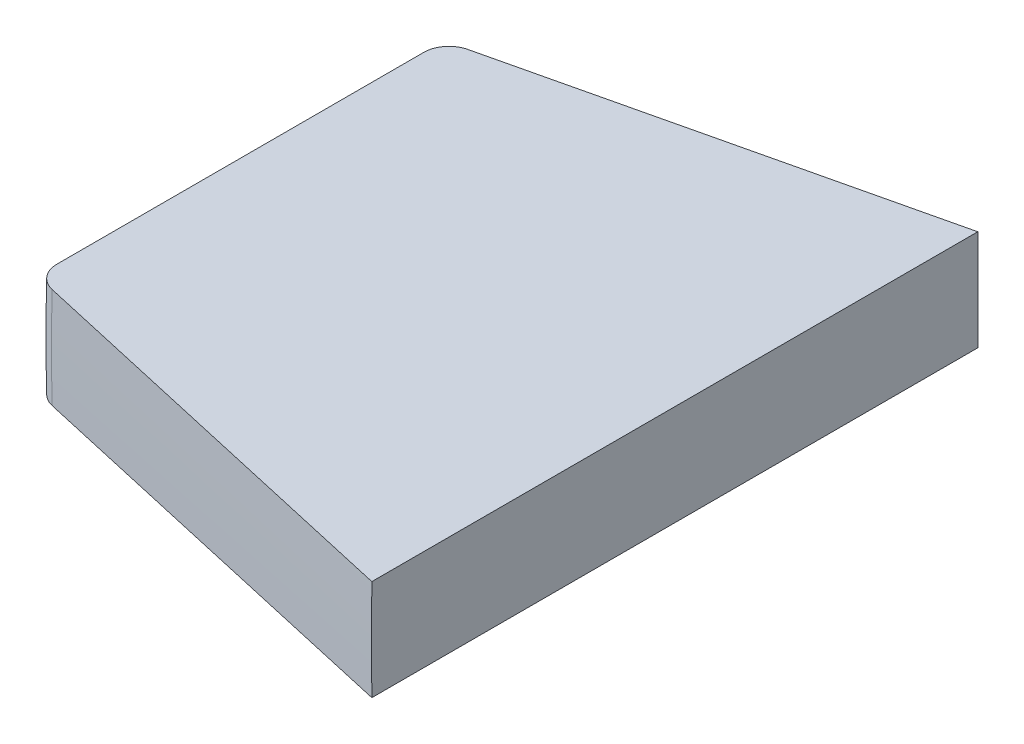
ISO-10303-21;
HEADER;
FILE_DESCRIPTION(('STEP AP214'),'2;1');
FILE_NAME('part.step','',(''),(''),'','','');
FILE_SCHEMA(('AUTOMOTIVE_DESIGN { 1 0 10303 214 1 1 1 1 }'));
ENDSEC;
DATA;
#1=APPLICATION_CONTEXT('core data for automotive mechanical design processes');
#2=APPLICATION_PROTOCOL_DEFINITION('international standard','automotive_design',2000,#1);
#3=PRODUCT_CONTEXT('',#1,'mechanical');
#4=PRODUCT('Part','Part','',(#3));
#5=PRODUCT_RELATED_PRODUCT_CATEGORY('part','',(#4));
#6=PRODUCT_DEFINITION_FORMATION('','',#4);
#7=PRODUCT_DEFINITION_CONTEXT('part definition',#1,'design');
#8=PRODUCT_DEFINITION('design','',#6,#7);
#9=PRODUCT_DEFINITION_SHAPE('','',#8);
#10=(LENGTH_UNIT() NAMED_UNIT(*) SI_UNIT(.MILLI.,.METRE.));
#11=(NAMED_UNIT(*) PLANE_ANGLE_UNIT() SI_UNIT($,.RADIAN.));
#12=(NAMED_UNIT(*) SI_UNIT($,.STERADIAN.) SOLID_ANGLE_UNIT());
#13=UNCERTAINTY_MEASURE_WITH_UNIT(LENGTH_MEASURE(1.E-05),#10,'distance_accuracy_value','');
#14=(GEOMETRIC_REPRESENTATION_CONTEXT(3) GLOBAL_UNCERTAINTY_ASSIGNED_CONTEXT((#13)) GLOBAL_UNIT_ASSIGNED_CONTEXT((#10,
#11,#12)) REPRESENTATION_CONTEXT('',''));
#15=CARTESIAN_POINT('',(0.,0.,0.));
#16=DIRECTION('',(0.,0.,1.));
#17=DIRECTION('',(1.,0.,0.));
#18=AXIS2_PLACEMENT_3D('',#15,#16,#17);
#19=CARTESIAN_POINT('',(-5.25274268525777E-12,7.08417699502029E-13,4.77559832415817));
#20=DIRECTION('',(0.,0.,-1.));
#21=DIRECTION('',(-1.,0.,0.));
#22=AXIS2_PLACEMENT_3D('',#19,#20,#21);
#23=TOROIDAL_SURFACE('',#22,33.114657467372,0.499999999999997);
#24=CARTESIAN_POINT('',(-33.2141183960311,-1.00000001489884,4.28888778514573));
#25=CARTESIAN_POINT('',(-33.2415169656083,-1.00000001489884,4.29530658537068));
#26=CARTESIAN_POINT('',(-33.2683547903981,-1.00000001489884,4.30407949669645));
#27=CARTESIAN_POINT('',(-33.3201764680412,-1.00000001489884,4.32598278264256));
#28=CARTESIAN_POINT('',(-33.3451611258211,-1.00000001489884,4.33911125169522));
#29=CARTESIAN_POINT('',(-33.3925792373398,-1.00000001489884,4.36938752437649));
#30=CARTESIAN_POINT('',(-33.4150116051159,-1.00000001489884,4.38653702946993));
#31=CARTESIAN_POINT('',(-33.4566700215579,-1.00000001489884,4.42435178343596));
#32=CARTESIAN_POINT('',(-33.4758972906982,-1.00000001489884,4.44501568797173));
#33=CARTESIAN_POINT('',(-33.5106030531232,-1.00000001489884,4.48927327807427));
#34=CARTESIAN_POINT('',(-33.5260825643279,-1.00000001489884,4.51286616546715));
#35=CARTESIAN_POINT('',(-33.5528659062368,-1.00000001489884,4.56232539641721));
#36=CARTESIAN_POINT('',(-33.5641683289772,-1.00000001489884,4.58819250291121));
#37=CARTESIAN_POINT('',(-33.5819881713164,-1.00000001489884,4.64065342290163));
#38=CARTESIAN_POINT('',(-33.588639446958,-1.00000001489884,4.66720188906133));
#39=CARTESIAN_POINT('',(-33.5975460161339,-1.00000001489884,4.72103042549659));
#40=CARTESIAN_POINT('',(-33.5998004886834,-1.00000001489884,4.74831063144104));
#41=CARTESIAN_POINT('',(-33.5997797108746,-1.00000001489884,4.77559832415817));
#42=B_SPLINE_CURVE_WITH_KNOTS('',3,(#24,#25,#26,#27,#28,#29,#30,#31,#32,#33,#34,#35,#36,#37,#38,
#39,#40,#41),.UNSPECIFIED.,.F.,.F.,(4,2,2,2,2,2,2,2,4),(0.,0.0843094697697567,0.16858210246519,
0.25289045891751,0.337166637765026,0.42141990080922,0.505701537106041,0.587444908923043,
0.66920354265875),.UNSPECIFIED.);
#43=CARTESIAN_POINT('',(-33.2141183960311,-1.00000001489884,4.28888778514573));
#44=VERTEX_POINT('',#43);
#45=CARTESIAN_POINT('',(-33.5997797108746,-1.00000001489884,4.77559832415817));
#46=VERTEX_POINT('',#45);
#47=EDGE_CURVE('E82',#44,#46,#42,.T.);
#48=ORIENTED_EDGE('',*,*,#47,.T.);
#49=CARTESIAN_POINT('',(6.39037434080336E-11,6.89444161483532E-13,4.77559832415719));
#50=DIRECTION('',(0.,0.,1.));
#51=DIRECTION('',(1.,0.,0.));
#52=AXIS2_PLACEMENT_3D('',#49,#50,#51);
#53=CIRCLE('',#52,33.6146574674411);
#54=CARTESIAN_POINT('',(-33.5997797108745,1.00000001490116,4.77559832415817));
#55=VERTEX_POINT('',#54);
#56=EDGE_CURVE('E80',#55,#46,#53,.T.);
#57=ORIENTED_EDGE('',*,*,#56,.F.);
#58=CARTESIAN_POINT('',(-33.5997797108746,1.00000001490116,4.77559832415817));
#59=CARTESIAN_POINT('',(-33.5998036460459,1.00000001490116,4.7474829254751));
#60=CARTESIAN_POINT('',(-33.597408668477,1.00000001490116,4.7193746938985));
#61=CARTESIAN_POINT('',(-33.5879559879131,1.00000001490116,4.66396589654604));
#62=CARTESIAN_POINT('',(-33.5809004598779,1.00000001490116,4.63666496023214));
#63=CARTESIAN_POINT('',(-33.5622976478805,1.00000001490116,4.58362548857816));
#64=CARTESIAN_POINT('',(-33.5507485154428,1.00000001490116,4.55788760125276));
#65=CARTESIAN_POINT('',(-33.5234998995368,1.00000001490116,4.50872473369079));
#66=CARTESIAN_POINT('',(-33.5078019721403,1.00000001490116,4.48529889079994));
#67=CARTESIAN_POINT('',(-33.4726941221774,1.00000001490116,4.44140918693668));
#68=CARTESIAN_POINT('',(-33.453283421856,1.00000001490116,4.42094594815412));
#69=CARTESIAN_POINT('',(-33.4112963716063,1.00000001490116,4.3835581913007));
#70=CARTESIAN_POINT('',(-33.3887189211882,1.00000001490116,4.36663490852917));
#71=CARTESIAN_POINT('',(-33.3416986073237,1.00000001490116,4.33723164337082));
#72=CARTESIAN_POINT('',(-33.3173238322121,1.00000001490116,4.32464259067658));
#73=CARTESIAN_POINT('',(-33.2668489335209,1.00000001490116,4.30359086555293));
#74=CARTESIAN_POINT('',(-33.2407485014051,1.00000001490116,4.29512893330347));
#75=CARTESIAN_POINT('',(-33.214118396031,1.00000001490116,4.28888778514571));
#76=B_SPLINE_CURVE_WITH_KNOTS('',3,(#58,#59,#60,#61,#62,#63,#64,#65,#66,#67,#68,#69,#70,#71,#72,
#73,#74,#75),.UNSPECIFIED.,.F.,.F.,(4,2,2,2,2,2,2,2,4),(0.,0.0842341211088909,0.168428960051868,
0.252658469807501,0.33685643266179,0.421072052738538,0.505317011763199,0.587252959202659,
0.669203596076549),.UNSPECIFIED.);
#77=CARTESIAN_POINT('',(-33.214118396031,1.00000001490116,4.28888778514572));
#78=VERTEX_POINT('',#77);
#79=EDGE_CURVE('E21',#55,#78,#76,.T.);
#80=ORIENTED_EDGE('',*,*,#79,.T.);
#81=CARTESIAN_POINT('',(-2.87825319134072E-11,1.80129348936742E-12,4.28888778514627));
#82=DIRECTION('',(0.,0.,-1.));
#83=DIRECTION('',(-1.,0.,0.));
#84=AXIS2_PLACEMENT_3D('',#81,#82,#83);
#85=CIRCLE('',#84,33.2291688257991);
#86=EDGE_CURVE('E77',#44,#78,#85,.T.);
#87=ORIENTED_EDGE('',*,*,#86,.F.);
#88=EDGE_LOOP('',(#48,#57,#80,#87));
#89=FACE_BOUND('',#88,.T.);
#90=ADVANCED_FACE('F16',(#89),#23,.T.);
#91=CARTESIAN_POINT('',(6.39037434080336E-11,6.89444161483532E-13,4.77559832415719));
#92=DIRECTION('',(0.,0.,1.));
#93=DIRECTION('',(1.,0.,0.));
#94=AXIS2_PLACEMENT_3D('',#91,#92,#93);
#95=CYLINDRICAL_SURFACE('',#94,33.6146574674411);
#96=DIRECTION('',(0.,0.,-1.));
#97=VECTOR('',#96,1.);
#98=CARTESIAN_POINT('',(-33.5997797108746,-1.00000001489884,8.3835522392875));
#99=LINE('',#98,#97);
#100=CARTESIAN_POINT('',(-33.5997797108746,-1.00000001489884,12.070682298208));
#101=VERTEX_POINT('',#100);
#102=EDGE_CURVE('E129',#101,#46,#99,.T.);
#103=ORIENTED_EDGE('',*,*,#102,.F.);
#104=CARTESIAN_POINT('',(9.92955717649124E-12,7.38341679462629E-13,12.070682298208));
#105=DIRECTION('',(0.,0.,1.));
#106=DIRECTION('',(1.,0.,0.));
#107=AXIS2_PLACEMENT_3D('',#104,#105,#106);
#108=CIRCLE('',#107,33.6146574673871);
#109=CARTESIAN_POINT('',(-33.5997797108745,1.00000001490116,12.070682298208));
#110=VERTEX_POINT('',#109);
#111=EDGE_CURVE('E166',#110,#101,#108,.T.);
#112=ORIENTED_EDGE('',*,*,#111,.F.);
#113=DIRECTION('',(0.,0.,1.));
#114=VECTOR('',#113,1.);
#115=CARTESIAN_POINT('',(-33.5997797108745,1.00000001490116,8.38355223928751));
#116=LINE('',#115,#114);
#117=EDGE_CURVE('E94',#55,#110,#116,.T.);
#118=ORIENTED_EDGE('',*,*,#117,.F.);
#119=ORIENTED_EDGE('',*,*,#56,.T.);
#120=EDGE_LOOP('',(#103,#112,#118,#119));
#121=FACE_BOUND('',#120,.T.);
#122=ADVANCED_FACE('F116',(#121),#95,.T.);
#123=CARTESIAN_POINT('',(1.04239533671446E-11,1.07357699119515E-12,2.35119072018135));
#124=DIRECTION('',(0.,0.,1.));
#125=DIRECTION('',(1.,0.,0.));
#126=AXIS2_PLACEMENT_3D('',#123,#124,#125);
#127=CONICAL_SURFACE('',#126,24.9933257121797,1.33972273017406);
#128=CARTESIAN_POINT('',(-33.2141183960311,-1.00000001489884,4.28888778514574));
#129=CARTESIAN_POINT('',(-31.8451108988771,-1.00000001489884,3.96693217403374));
#130=CARTESIAN_POINT('',(-30.4760973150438,-1.00000001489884,3.6450024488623));
#131=CARTESIAN_POINT('',(-27.7380579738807,-1.00000001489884,3.00119477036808));
#132=CARTESIAN_POINT('',(-26.3690322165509,-1.00000001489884,2.67931681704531));
#133=CARTESIAN_POINT('',(-25.0000003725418,-1.00000001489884,2.3574647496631));
#134=B_SPLINE_CURVE_WITH_KNOTS('',3,(#128,#129,#130,#131,#132,#133),.UNSPECIFIED.,.F.,.F.,(4,2,
4),(0.,4.21906772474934,8.43813544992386),.UNSPECIFIED.);
#135=CARTESIAN_POINT('',(-25.0000003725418,-1.00000001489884,2.3574647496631));
#136=VERTEX_POINT('',#135);
#137=EDGE_CURVE('E88',#44,#136,#134,.T.);
#138=ORIENTED_EDGE('',*,*,#137,.F.);
#139=ORIENTED_EDGE('',*,*,#86,.T.);
#140=CARTESIAN_POINT('',(-25.0000003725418,1.00000001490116,2.3574647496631));
#141=CARTESIAN_POINT('',(-26.3690322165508,1.00000001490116,2.67931681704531));
#142=CARTESIAN_POINT('',(-27.7380579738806,1.00000001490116,3.00119477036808));
#143=CARTESIAN_POINT('',(-30.4760973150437,1.00000001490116,3.64500244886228));
#144=CARTESIAN_POINT('',(-31.845110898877,1.00000001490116,3.96693217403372));
#145=CARTESIAN_POINT('',(-33.214118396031,1.00000001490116,4.28888778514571));
#146=B_SPLINE_CURVE_WITH_KNOTS('',3,(#140,#141,#142,#143,#144,#145),.UNSPECIFIED.,.F.,.F.,(4,2,
4),(0.,4.21906772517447,8.43813544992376),.UNSPECIFIED.);
#147=CARTESIAN_POINT('',(-25.0000003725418,1.00000001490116,2.3574647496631));
#148=VERTEX_POINT('',#147);
#149=EDGE_CURVE('E86',#148,#78,#146,.T.);
#150=ORIENTED_EDGE('',*,*,#149,.F.);
#151=CARTESIAN_POINT('',(-25.0000003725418,-1.00000001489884,2.3574647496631));
#152=CARTESIAN_POINT('',(-25.0000003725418,-0.666666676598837,2.35432898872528));
#153=CARTESIAN_POINT('',(-25.0000003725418,-0.333333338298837,2.35276110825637));
#154=CARTESIAN_POINT('',(-25.0000003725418,0.333333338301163,2.35276110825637));
#155=CARTESIAN_POINT('',(-25.0000003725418,0.666666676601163,2.35432898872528));
#156=CARTESIAN_POINT('',(-25.0000003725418,1.00000001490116,2.3574647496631));
#157=B_SPLINE_CURVE_WITH_KNOTS('',3,(#151,#152,#153,#154,#155,#156),.UNSPECIFIED.,.F.,.F.,(4,2,
4),(0.,1.00001107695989,2.00002215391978),.UNSPECIFIED.);
#158=EDGE_CURVE('E120',#136,#148,#157,.T.);
#159=ORIENTED_EDGE('',*,*,#158,.F.);
#160=EDGE_LOOP('',(#138,#139,#150,#159));
#161=FACE_BOUND('',#160,.T.);
#162=ADVANCED_FACE('F84',(#161),#127,.T.);
#163=CARTESIAN_POINT('',(-33.6097797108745,1.00000001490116,14.4196397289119));
#164=DIRECTION('',(0.,1.,0.));
#165=DIRECTION('',(1.,0.,0.));
#166=AXIS2_PLACEMENT_3D('',#163,#164,#165);
#167=PLANE('',#166);
#168=ORIENTED_EDGE('',*,*,#117,.T.);
#169=CARTESIAN_POINT('',(-33.2096529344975,1.00000001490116,12.5584214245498));
#170=CARTESIAN_POINT('',(-33.2371092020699,1.00000001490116,12.5522537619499));
#171=CARTESIAN_POINT('',(-33.264026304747,1.00000001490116,12.5437269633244));
#172=CARTESIAN_POINT('',(-33.3160469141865,1.00000001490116,12.5222989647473));
#173=CARTESIAN_POINT('',(-33.3411511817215,1.00000001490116,12.5093996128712));
#174=CARTESIAN_POINT('',(-33.3888453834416,1.00000001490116,12.4795582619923));
#175=CARTESIAN_POINT('',(-33.4114342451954,1.00000001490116,12.4626145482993));
#176=CARTESIAN_POINT('',(-33.4534375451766,1.00000001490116,12.4251824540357));
#177=CARTESIAN_POINT('',(-33.4728532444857,1.00000001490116,12.4046954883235));
#178=CARTESIAN_POINT('',(-33.5079626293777,1.00000001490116,12.360757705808));
#179=CARTESIAN_POINT('',(-33.5236573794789,1.00000001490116,12.3373077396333));
#180=CARTESIAN_POINT('',(-33.550893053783,1.00000001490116,12.28809582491));
#181=CARTESIAN_POINT('',(-33.562432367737,1.00000001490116,12.2623329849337));
#182=CARTESIAN_POINT('',(-33.5809823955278,1.00000001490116,12.20931961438));
#183=CARTESIAN_POINT('',(-33.5880075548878,1.00000001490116,12.1820741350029));
#184=CARTESIAN_POINT('',(-33.5974190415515,1.00000001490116,12.1267825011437));
#185=CARTESIAN_POINT('',(-33.5998033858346,1.00000001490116,12.0987360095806));
#186=CARTESIAN_POINT('',(-33.5997797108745,1.00000001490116,12.070682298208));
#187=B_SPLINE_CURVE_WITH_KNOTS('',3,(#169,#170,#171,#172,#173,#174,#175,#176,#177,#178,#179,
#180,#181,#182,#183,#184,#185,#186),.UNSPECIFIED.,.F.,.F.,(4,2,2,2,2,2,2,2,4),(0.,
0.0843096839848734,0.168583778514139,0.252893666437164,0.337169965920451,0.421422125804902,
0.505706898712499,0.589720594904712,0.67377018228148),.UNSPECIFIED.);
#188=CARTESIAN_POINT('',(-33.2096529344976,1.00000001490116,12.5584214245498));
#189=VERTEX_POINT('',#188);
#190=EDGE_CURVE('E96',#189,#110,#187,.T.);
#191=ORIENTED_EDGE('',*,*,#190,.F.);
#192=CARTESIAN_POINT('',(-25.0000003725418,1.00000001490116,14.4096397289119));
#193=CARTESIAN_POINT('',(-26.3682870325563,1.00000001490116,14.1011531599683));
#194=CARTESIAN_POINT('',(-27.7365680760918,1.00000001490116,13.7926416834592));
#195=CARTESIAN_POINT('',(-30.4731189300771,1.00000001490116,13.1755689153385));
#196=CARTESIAN_POINT('',(-31.8413887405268,1.00000001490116,12.867007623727));
#197=CARTESIAN_POINT('',(-33.2096529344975,1.00000001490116,12.5584214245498));
#198=B_SPLINE_CURVE_WITH_KNOTS('',3,(#192,#193,#194,#195,#196,#197),.UNSPECIFIED.,.F.,.F.,(4,2,
4),(0.,4.20789152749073,8.41578305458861),.UNSPECIFIED.);
#199=CARTESIAN_POINT('',(-25.0000003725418,1.00000001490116,14.4096397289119));
#200=VERTEX_POINT('',#199);
#201=EDGE_CURVE('E152',#200,#189,#198,.T.);
#202=ORIENTED_EDGE('',*,*,#201,.F.);
#203=DIRECTION('',(0.,0.,1.));
#204=VECTOR('',#203,1.);
#205=CARTESIAN_POINT('',(-25.0000003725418,1.00000001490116,8.38335944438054));
#206=LINE('',#205,#204);
#207=EDGE_CURVE('E92',#148,#200,#206,.T.);
#208=ORIENTED_EDGE('',*,*,#207,.F.);
#209=ORIENTED_EDGE('',*,*,#149,.T.);
#210=ORIENTED_EDGE('',*,*,#79,.F.);
#211=EDGE_LOOP('',(#168,#191,#202,#208,#209,#210));
#212=FACE_BOUND('',#211,.T.);
#213=ADVANCED_FACE('F90',(#212),#167,.T.);
#214=CARTESIAN_POINT('',(9.92955717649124E-12,7.38341679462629E-13,12.070682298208));
#215=DIRECTION('',(0.,0.,-1.));
#216=DIRECTION('',(-1.,0.,0.));
#217=AXIS2_PLACEMENT_3D('',#214,#215,#216);
#218=TOROIDAL_SURFACE('',#217,33.1146574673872,0.499999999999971);
#219=CARTESIAN_POINT('',(-33.2096529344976,-1.00000001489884,12.5584214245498));
#220=CARTESIAN_POINT('',(-33.23710920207,-1.00000001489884,12.5522537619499));
#221=CARTESIAN_POINT('',(-33.2640263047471,-1.00000001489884,12.5437269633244));
#222=CARTESIAN_POINT('',(-33.3160469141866,-1.00000001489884,12.5222989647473));
#223=CARTESIAN_POINT('',(-33.3411511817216,-1.00000001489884,12.5093996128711));
#224=CARTESIAN_POINT('',(-33.3888453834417,-1.00000001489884,12.4795582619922));
#225=CARTESIAN_POINT('',(-33.4114342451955,-1.00000001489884,12.4626145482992));
#226=CARTESIAN_POINT('',(-33.4534375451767,-1.00000001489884,12.4251824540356));
#227=CARTESIAN_POINT('',(-33.4728532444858,-1.00000001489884,12.4046954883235));
#228=CARTESIAN_POINT('',(-33.5079626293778,-1.00000001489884,12.360757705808));
#229=CARTESIAN_POINT('',(-33.5236573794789,-1.00000001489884,12.3373077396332));
#230=CARTESIAN_POINT('',(-33.5508930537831,-1.00000001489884,12.2880958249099));
#231=CARTESIAN_POINT('',(-33.5624323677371,-1.00000001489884,12.2623329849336));
#232=CARTESIAN_POINT('',(-33.5809823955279,-1.00000001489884,12.2093196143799));
#233=CARTESIAN_POINT('',(-33.5880075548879,-1.00000001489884,12.1820741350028));
#234=CARTESIAN_POINT('',(-33.5974190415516,-1.00000001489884,12.1267825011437));
#235=CARTESIAN_POINT('',(-33.5998033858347,-1.00000001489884,12.0987360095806));
#236=CARTESIAN_POINT('',(-33.5997797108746,-1.00000001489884,12.070682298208));
#237=B_SPLINE_CURVE_WITH_KNOTS('',3,(#219,#220,#221,#222,#223,#224,#225,#226,#227,#228,#229,
#230,#231,#232,#233,#234,#235,#236),.UNSPECIFIED.,.F.,.F.,(4,2,2,2,2,2,2,2,4),(0.,
0.084309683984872,0.168583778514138,0.252893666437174,0.337169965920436,0.421422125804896,
0.505706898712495,0.589720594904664,0.673770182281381),.UNSPECIFIED.);
#238=CARTESIAN_POINT('',(-33.2096529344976,-1.00000001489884,12.5584214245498));
#239=VERTEX_POINT('',#238);
#240=EDGE_CURVE('E130',#239,#101,#237,.T.);
#241=ORIENTED_EDGE('',*,*,#240,.F.);
#242=CARTESIAN_POINT('',(-4.64212002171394E-12,5.88830199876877E-13,12.5584214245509));
#243=DIRECTION('',(0.,0.,1.));
#244=DIRECTION('',(1.,0.,0.));
#245=AXIS2_PLACEMENT_3D('',#242,#243,#244);
#246=CIRCLE('',#245,33.2247053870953);
#247=EDGE_CURVE('E149',#189,#239,#246,.T.);
#248=ORIENTED_EDGE('',*,*,#247,.F.);
#249=ORIENTED_EDGE('',*,*,#190,.T.);
#250=ORIENTED_EDGE('',*,*,#111,.T.);
#251=EDGE_LOOP('',(#241,#248,#249,#250));
#252=FACE_BOUND('',#251,.T.);
#253=ADVANCED_FACE('F138',(#252),#218,.T.);
#254=CARTESIAN_POINT('',(-24.9900003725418,-1.00000001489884,14.4196397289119));
#255=DIRECTION('',(0.,-1.,0.));
#256=DIRECTION('',(-1.,0.,0.));
#257=AXIS2_PLACEMENT_3D('',#254,#255,#256);
#258=PLANE('',#257);
#259=ORIENTED_EDGE('',*,*,#137,.T.);
#260=DIRECTION('',(0.,0.,-1.));
#261=VECTOR('',#260,1.);
#262=CARTESIAN_POINT('',(-25.0000003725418,-1.00000001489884,8.38335944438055));
#263=LINE('',#262,#261);
#264=CARTESIAN_POINT('',(-25.0000003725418,-1.00000001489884,14.4096397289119));
#265=VERTEX_POINT('',#264);
#266=EDGE_CURVE('E41',#265,#136,#263,.T.);
#267=ORIENTED_EDGE('',*,*,#266,.F.);
#268=CARTESIAN_POINT('',(-33.2096529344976,-1.00000001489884,12.5584214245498));
#269=CARTESIAN_POINT('',(-31.8413887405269,-1.00000001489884,12.867007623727));
#270=CARTESIAN_POINT('',(-30.4731189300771,-1.00000001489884,13.1755689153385));
#271=CARTESIAN_POINT('',(-27.7365680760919,-1.00000001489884,13.7926416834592));
#272=CARTESIAN_POINT('',(-26.3682870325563,-1.00000001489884,14.1011531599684));
#273=CARTESIAN_POINT('',(-25.0000003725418,-1.00000001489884,14.4096397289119));
#274=B_SPLINE_CURVE_WITH_KNOTS('',3,(#268,#269,#270,#271,#272,#273),.UNSPECIFIED.,.F.,.F.,(4,2,
4),(0.,4.20789152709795,8.41578305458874),.UNSPECIFIED.);
#275=EDGE_CURVE('E32',#239,#265,#274,.T.);
#276=ORIENTED_EDGE('',*,*,#275,.F.);
#277=ORIENTED_EDGE('',*,*,#240,.T.);
#278=ORIENTED_EDGE('',*,*,#102,.T.);
#279=ORIENTED_EDGE('',*,*,#47,.F.);
#280=EDGE_LOOP('',(#259,#267,#276,#277,#278,#279));
#281=FACE_BOUND('',#280,.T.);
#282=ADVANCED_FACE('F134',(#281),#258,.T.);
#283=CARTESIAN_POINT('',(-25.0000003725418,1.01000001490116,2.33806122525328));
#284=DIRECTION('',(1.,0.,0.));
#285=DIRECTION('',(0.,0.,1.));
#286=AXIS2_PLACEMENT_3D('',#283,#284,#285);
#287=PLANE('',#286);
#288=ORIENTED_EDGE('',*,*,#158,.T.);
#289=ORIENTED_EDGE('',*,*,#207,.T.);
#290=CARTESIAN_POINT('',(-25.0000003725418,-1.00000001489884,14.4096397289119));
#291=CARTESIAN_POINT('',(-25.0000002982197,-0.91665199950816,14.4103913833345));
#292=CARTESIAN_POINT('',(-25.0000001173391,-0.833303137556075,14.411049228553));
#293=CARTESIAN_POINT('',(-24.9999998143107,-0.666626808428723,14.4121769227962));
#294=CARTESIAN_POINT('',(-24.9999996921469,-0.583299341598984,14.4126468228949));
#295=CARTESIAN_POINT('',(-24.9999997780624,-0.416649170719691,14.4133986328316));
#296=CARTESIAN_POINT('',(-24.9999999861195,-0.333326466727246,14.413680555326));
#297=CARTESIAN_POINT('',(-25.0000004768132,-0.166669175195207,14.4140564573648));
#298=CARTESIAN_POINT('',(-25.0000007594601,-0.0833345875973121,14.4141504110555));
#299=CARTESIAN_POINT('',(-25.0000007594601,0.0833345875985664,14.4141504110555));
#300=CARTESIAN_POINT('',(-25.0000004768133,0.16666917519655,14.4140564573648));
#301=CARTESIAN_POINT('',(-24.9999999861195,0.333326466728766,14.413680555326));
#302=CARTESIAN_POINT('',(-24.9999997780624,0.416649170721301,14.4133986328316));
#303=CARTESIAN_POINT('',(-24.9999996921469,0.583299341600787,14.4126468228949));
#304=CARTESIAN_POINT('',(-24.9999998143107,0.666626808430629,14.4121769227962));
#305=CARTESIAN_POINT('',(-25.0000001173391,0.833303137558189,14.411049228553));
#306=CARTESIAN_POINT('',(-25.0000002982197,0.916651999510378,14.4103913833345));
#307=CARTESIAN_POINT('',(-25.0000003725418,1.00000001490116,14.4096397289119));
#308=B_SPLINE_CURVE_WITH_KNOTS('',3,(#290,#291,#292,#293,#294,#295,#296,#297,#298,#299,#300,
#301,#302,#303,#304,#305,#306,#307),.UNSPECIFIED.,.F.,.F.,(4,2,2,2,2,2,2,2,4),(0.,
0.250054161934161,0.500040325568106,0.750009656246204,1.00001336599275,1.25001707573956,
1.49998640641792,1.74997257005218,2.00002673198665),.UNSPECIFIED.);
#309=EDGE_CURVE('E11',#265,#200,#308,.T.);
#310=ORIENTED_EDGE('',*,*,#309,.F.);
#311=ORIENTED_EDGE('',*,*,#266,.T.);
#312=EDGE_LOOP('',(#288,#289,#310,#311));
#313=FACE_BOUND('',#312,.T.);
#314=ADVANCED_FACE('F137',(#313),#287,.T.);
#315=CARTESIAN_POINT('',(-4.64212002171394E-12,5.88830199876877E-13,12.5584214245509));
#316=DIRECTION('',(0.,0.,-1.));
#317=DIRECTION('',(-1.,0.,0.));
#318=AXIS2_PLACEMENT_3D('',#315,#316,#317);
#319=CONICAL_SURFACE('',#318,33.2247053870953,1.34888360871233);
#320=ORIENTED_EDGE('',*,*,#275,.T.);
#321=ORIENTED_EDGE('',*,*,#309,.T.);
#322=ORIENTED_EDGE('',*,*,#201,.T.);
#323=ORIENTED_EDGE('',*,*,#247,.T.);
#324=EDGE_LOOP('',(#320,#321,#322,#323));
#325=FACE_BOUND('',#324,.T.);
#326=ADVANCED_FACE('F18',(#325),#319,.T.);
#327=CLOSED_SHELL('',(#90,#122,#162,#213,#253,#282,#314,#326));
#328=MANIFOLD_SOLID_BREP('B1',#327);
#329=ADVANCED_BREP_SHAPE_REPRESENTATION('',(#18,#328),#14);
#330=SHAPE_DEFINITION_REPRESENTATION(#9,#329);
ENDSEC;
END-ISO-10303-21;
